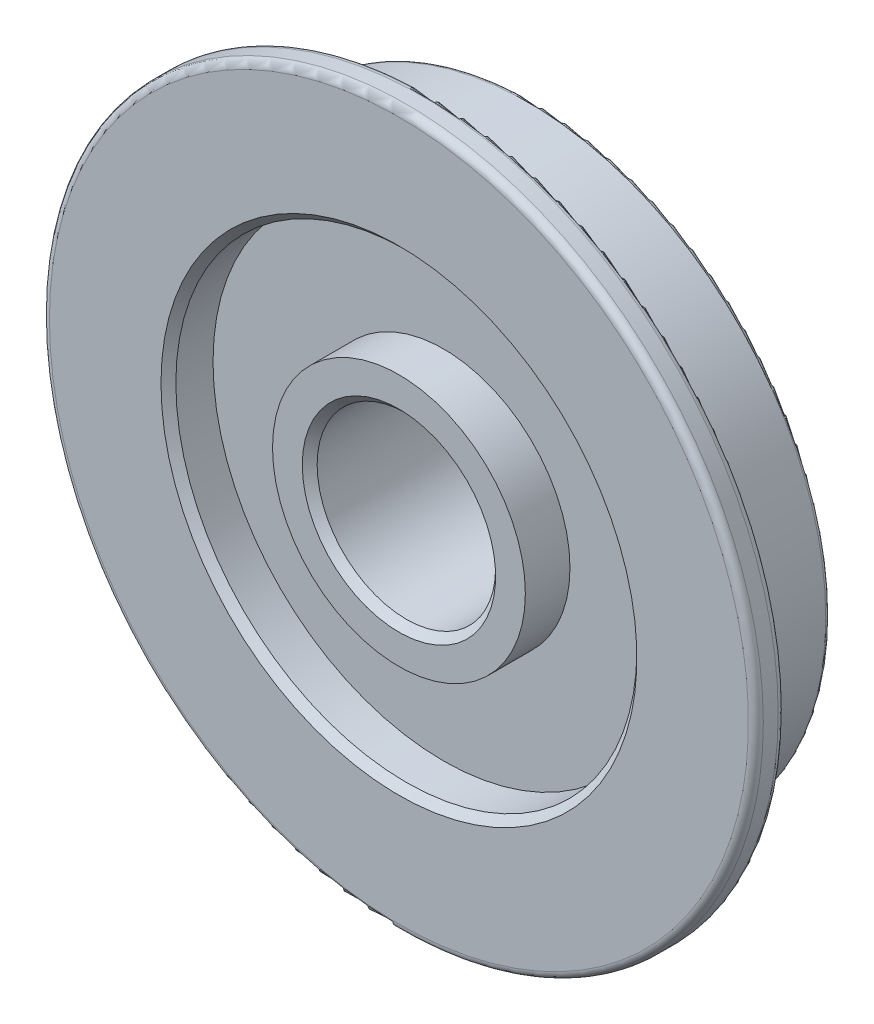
ISO-10303-21;
HEADER;
FILE_DESCRIPTION(('STEP AP214'),'2;1');
FILE_NAME('part.step','',(''),(''),'','','');
FILE_SCHEMA(('AUTOMOTIVE_DESIGN { 1 0 10303 214 1 1 1 1 }'));
ENDSEC;
DATA;
#1=APPLICATION_CONTEXT('core data for automotive mechanical design processes');
#2=APPLICATION_PROTOCOL_DEFINITION('international standard','automotive_design',2000,#1);
#3=PRODUCT_CONTEXT('',#1,'mechanical');
#4=PRODUCT('Part','Part','',(#3));
#5=PRODUCT_RELATED_PRODUCT_CATEGORY('part','',(#4));
#6=PRODUCT_DEFINITION_FORMATION('','',#4);
#7=PRODUCT_DEFINITION_CONTEXT('part definition',#1,'design');
#8=PRODUCT_DEFINITION('design','',#6,#7);
#9=PRODUCT_DEFINITION_SHAPE('','',#8);
#10=(LENGTH_UNIT() NAMED_UNIT(*) SI_UNIT(.MILLI.,.METRE.));
#11=(NAMED_UNIT(*) PLANE_ANGLE_UNIT() SI_UNIT($,.RADIAN.));
#12=(NAMED_UNIT(*) SI_UNIT($,.STERADIAN.) SOLID_ANGLE_UNIT());
#13=UNCERTAINTY_MEASURE_WITH_UNIT(LENGTH_MEASURE(1.E-05),#10,'distance_accuracy_value','');
#14=(GEOMETRIC_REPRESENTATION_CONTEXT(3) GLOBAL_UNCERTAINTY_ASSIGNED_CONTEXT((#13)) GLOBAL_UNIT_ASSIGNED_CONTEXT((#10,
#11,#12)) REPRESENTATION_CONTEXT('',''));
#15=CARTESIAN_POINT('',(0.,0.,0.));
#16=DIRECTION('',(0.,0.,1.));
#17=DIRECTION('',(1.,0.,0.));
#18=AXIS2_PLACEMENT_3D('',#15,#16,#17);
#19=CARTESIAN_POINT('',(-6.38378239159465E-13,2.49713444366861E-12,50.));
#20=DIRECTION('',(0.,0.,1.));
#21=DIRECTION('',(1.00000000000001,0.,0.));
#22=AXIS2_PLACEMENT_3D('',#19,#20,#21);
#23=CYLINDRICAL_SURFACE('',#22,8.49999999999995);
#24=CARTESIAN_POINT('',(0.,0.,0.));
#25=DIRECTION('',(0.,0.,1.));
#26=DIRECTION('',(1.00000000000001,0.,0.));
#27=AXIS2_PLACEMENT_3D('',#24,#25,#26);
#28=CIRCLE('',#27,8.49999999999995);
#29=CARTESIAN_POINT('',(8.50000000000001,0.,0.));
#30=VERTEX_POINT('',#29);
#31=EDGE_CURVE('E77',#30,#30,#28,.T.);
#32=ORIENTED_EDGE('',*,*,#31,.F.);
#33=EDGE_LOOP('',(#32));
#34=FACE_BOUND('',#33,.T.);
#35=CARTESIAN_POINT('',(-3.91700560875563E-12,1.40998324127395E-11,-3.));
#36=DIRECTION('',(0.,0.,1.));
#37=DIRECTION('',(1.00000000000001,0.,0.));
#38=AXIS2_PLACEMENT_3D('',#35,#36,#37);
#39=CIRCLE('',#38,8.49999999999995);
#40=CARTESIAN_POINT('',(8.4999999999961,1.41270614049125E-11,-3.));
#41=VERTEX_POINT('',#40);
#42=EDGE_CURVE('E89',#41,#41,#39,.T.);
#43=ORIENTED_EDGE('',*,*,#42,.T.);
#44=EDGE_LOOP('',(#43));
#45=FACE_BOUND('',#44,.T.);
#46=ADVANCED_FACE('F28',(#34,#45),#23,.T.);
#47=CARTESIAN_POINT('',(0.,6.00000000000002,0.));
#48=DIRECTION('',(0.,0.,-1.));
#49=DIRECTION('',(-1.00000000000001,0.,0.));
#50=AXIS2_PLACEMENT_3D('',#47,#48,#49);
#51=PLANE('',#50);
#52=CARTESIAN_POINT('',(0.,0.,0.));
#53=DIRECTION('',(0.,0.,-1.));
#54=DIRECTION('',(-1.00000000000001,0.,0.));
#55=AXIS2_PLACEMENT_3D('',#52,#53,#54);
#56=CIRCLE('',#55,6.5);
#57=CARTESIAN_POINT('',(-6.50000000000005,0.,0.));
#58=VERTEX_POINT('',#57);
#59=EDGE_CURVE('E71',#58,#58,#56,.T.);
#60=ORIENTED_EDGE('',*,*,#59,.T.);
#61=EDGE_LOOP('',(#60));
#62=FACE_BOUND('',#61,.T.);
#63=ORIENTED_EDGE('',*,*,#31,.T.);
#64=EDGE_LOOP('',(#63));
#65=FACE_BOUND('',#64,.T.);
#66=ADVANCED_FACE('F113',(#62,#65),#51,.F.);
#67=CARTESIAN_POINT('',(-6.38378239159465E-13,2.49713444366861E-12,50.));
#68=DIRECTION('',(0.,0.,1.));
#69=DIRECTION('',(1.00000000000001,0.,0.));
#70=AXIS2_PLACEMENT_3D('',#67,#68,#69);
#71=CYLINDRICAL_SURFACE('',#70,6.);
#72=CARTESIAN_POINT('',(0.,3.20056481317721E-13,-10.));
#73=DIRECTION('',(0.,0.,1.));
#74=DIRECTION('',(1.00000000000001,0.,0.));
#75=AXIS2_PLACEMENT_3D('',#72,#73,#74);
#76=CIRCLE('',#75,6.);
#77=CARTESIAN_POINT('',(6.00000000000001,3.39276946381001E-13,-10.));
#78=VERTEX_POINT('',#77);
#79=EDGE_CURVE('E10',#78,#78,#76,.F.);
#80=ORIENTED_EDGE('',*,*,#79,.T.);
#81=EDGE_LOOP('',(#80));
#82=FACE_BOUND('',#81,.T.);
#83=CARTESIAN_POINT('',(0.,0.,-0.5));
#84=DIRECTION('',(0.,0.,-1.));
#85=DIRECTION('',(-1.00000000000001,0.,0.));
#86=AXIS2_PLACEMENT_3D('',#83,#84,#85);
#87=CIRCLE('',#86,6.);
#88=CARTESIAN_POINT('',(-6.00000000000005,0.,-0.500000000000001));
#89=VERTEX_POINT('',#88);
#90=EDGE_CURVE('E74',#89,#89,#87,.F.);
#91=ORIENTED_EDGE('',*,*,#90,.T.);
#92=EDGE_LOOP('',(#91));
#93=FACE_BOUND('',#92,.T.);
#94=ADVANCED_FACE('F118',(#82,#93),#71,.F.);
#95=CARTESIAN_POINT('',(1.42247325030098E-13,13.7500000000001,-11.9999999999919));
#96=DIRECTION('',(0.,0.,1.));
#97=DIRECTION('',(1.00000000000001,0.,0.));
#98=AXIS2_PLACEMENT_3D('',#95,#96,#97);
#99=PLANE('',#98);
#100=CARTESIAN_POINT('',(0.,2.77555756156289E-13,-12.));
#101=DIRECTION('',(0.,0.,1.));
#102=DIRECTION('',(1.00000000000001,0.,0.));
#103=AXIS2_PLACEMENT_3D('',#100,#101,#102);
#104=CIRCLE('',#103,8.00000000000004);
#105=CARTESIAN_POINT('',(8.00000000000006,3.03183042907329E-13,-12.));
#106=VERTEX_POINT('',#105);
#107=EDGE_CURVE('E34',#106,#106,#104,.T.);
#108=ORIENTED_EDGE('',*,*,#107,.T.);
#109=EDGE_LOOP('',(#108));
#110=FACE_BOUND('',#109,.T.);
#111=CARTESIAN_POINT('',(0.,2.77555756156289E-13,-12.));
#112=DIRECTION('',(0.,0.,1.));
#113=DIRECTION('',(1.00000000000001,0.,0.));
#114=AXIS2_PLACEMENT_3D('',#111,#112,#113);
#115=CIRCLE('',#114,13.45);
#116=CARTESIAN_POINT('',(13.4500000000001,3.20641632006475E-13,-12.));
#117=VERTEX_POINT('',#116);
#118=EDGE_CURVE('E38',#117,#117,#115,.F.);
#119=ORIENTED_EDGE('',*,*,#118,.T.);
#120=EDGE_LOOP('',(#119));
#121=FACE_BOUND('',#120,.T.);
#122=ADVANCED_FACE('F125',(#110,#121),#99,.F.);
#123=CARTESIAN_POINT('',(-6.38378239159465E-13,2.49713444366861E-12,50.));
#124=DIRECTION('',(0.,0.,1.));
#125=DIRECTION('',(1.00000000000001,0.,0.));
#126=AXIS2_PLACEMENT_3D('',#123,#124,#125);
#127=CYLINDRICAL_SURFACE('',#126,13.75);
#128=CARTESIAN_POINT('',(0.,2.77555756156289E-13,-11.7));
#129=DIRECTION('',(0.,0.,1.));
#130=DIRECTION('',(1.00000000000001,0.,0.));
#131=AXIS2_PLACEMENT_3D('',#128,#129,#130);
#132=CIRCLE('',#131,13.75);
#133=CARTESIAN_POINT('',(13.7500000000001,3.21602655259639E-13,-11.7));
#134=VERTEX_POINT('',#133);
#135=EDGE_CURVE('E42',#134,#134,#132,.T.);
#136=ORIENTED_EDGE('',*,*,#135,.T.);
#137=EDGE_LOOP('',(#136));
#138=FACE_BOUND('',#137,.T.);
#139=CARTESIAN_POINT('',(0.,3.7470027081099E-13,-9.00000000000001));
#140=DIRECTION('',(0.,0.,1.));
#141=DIRECTION('',(1.00000000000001,0.,0.));
#142=AXIS2_PLACEMENT_3D('',#139,#140,#141);
#143=CIRCLE('',#142,13.75);
#144=CARTESIAN_POINT('',(13.75,4.1874716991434E-13,-9.00000000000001));
#145=VERTEX_POINT('',#144);
#146=EDGE_CURVE('E80',#145,#145,#143,.T.);
#147=ORIENTED_EDGE('',*,*,#146,.F.);
#148=EDGE_LOOP('',(#147));
#149=FACE_BOUND('',#148,.T.);
#150=ADVANCED_FACE('F130',(#138,#149),#127,.T.);
#151=CARTESIAN_POINT('',(-7.45931094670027E-13,20.0000000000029,-8.99999999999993));
#152=DIRECTION('',(0.,0.,1.));
#153=DIRECTION('',(1.00000000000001,0.,0.));
#154=AXIS2_PLACEMENT_3D('',#151,#152,#153);
#155=PLANE('',#154);
#156=CARTESIAN_POINT('',(0.,3.7470027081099E-13,-9.00000000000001));
#157=DIRECTION('',(0.,0.,1.));
#158=DIRECTION('',(1.00000000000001,0.,0.));
#159=AXIS2_PLACEMENT_3D('',#156,#157,#158);
#160=CIRCLE('',#159,19.7);
#161=CARTESIAN_POINT('',(19.7000000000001,4.37807464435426E-13,-9.00000000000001));
#162=VERTEX_POINT('',#161);
#163=EDGE_CURVE('E47',#162,#162,#160,.F.);
#164=ORIENTED_EDGE('',*,*,#163,.T.);
#165=EDGE_LOOP('',(#164));
#166=FACE_BOUND('',#165,.T.);
#167=ORIENTED_EDGE('',*,*,#146,.T.);
#168=EDGE_LOOP('',(#167));
#169=FACE_BOUND('',#168,.T.);
#170=ADVANCED_FACE('F133',(#166,#169),#155,.F.);
#171=CARTESIAN_POINT('',(-6.38378239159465E-13,2.49713444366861E-12,50.));
#172=DIRECTION('',(0.,0.,1.));
#173=DIRECTION('',(1.00000000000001,0.,0.));
#174=AXIS2_PLACEMENT_3D('',#171,#172,#173);
#175=CYLINDRICAL_SURFACE('',#174,20.);
#176=CARTESIAN_POINT('',(-3.88578058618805E-13,1.37390099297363E-12,-8.69999999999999));
#177=DIRECTION('',(0.,0.,1.));
#178=DIRECTION('',(1.00000000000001,0.,0.));
#179=AXIS2_PLACEMENT_3D('',#176,#177,#178);
#180=CIRCLE('',#179,20.);
#181=CARTESIAN_POINT('',(19.9999999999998,1.43796920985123E-12,-8.69999999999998));
#182=VERTEX_POINT('',#181);
#183=EDGE_CURVE('E50',#182,#182,#180,.T.);
#184=ORIENTED_EDGE('',*,*,#183,.T.);
#185=EDGE_LOOP('',(#184));
#186=FACE_BOUND('',#185,.T.);
#187=CARTESIAN_POINT('',(-3.86149445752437E-12,1.4210854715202E-11,-2.));
#188=DIRECTION('',(0.,0.,1.));
#189=DIRECTION('',(1.00000000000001,0.,0.));
#190=AXIS2_PLACEMENT_3D('',#187,#188,#189);
#191=CIRCLE('',#190,20.);
#192=CARTESIAN_POINT('',(19.9999999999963,1.42749229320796E-11,-2.));
#193=VERTEX_POINT('',#192);
#194=EDGE_CURVE('E83',#193,#193,#191,.T.);
#195=ORIENTED_EDGE('',*,*,#194,.F.);
#196=EDGE_LOOP('',(#195));
#197=FACE_BOUND('',#196,.T.);
#198=ADVANCED_FACE('F137',(#186,#197),#175,.T.);
#199=CARTESIAN_POINT('',(-1.66186508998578E-12,24.0000000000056,-2.));
#200=DIRECTION('',(0.,0.,1.));
#201=DIRECTION('',(1.00000000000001,0.,0.));
#202=AXIS2_PLACEMENT_3D('',#199,#200,#201);
#203=PLANE('',#202);
#204=CARTESIAN_POINT('',(-3.86149445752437E-12,1.4210854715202E-11,-2.));
#205=DIRECTION('',(0.,0.,1.));
#206=DIRECTION('',(1.00000000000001,0.,0.));
#207=AXIS2_PLACEMENT_3D('',#204,#205,#206);
#208=CIRCLE('',#207,23.5);
#209=CARTESIAN_POINT('',(23.4999999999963,1.42861348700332E-11,-2.));
#210=VERTEX_POINT('',#209);
#211=EDGE_CURVE('E53',#210,#210,#208,.F.);
#212=ORIENTED_EDGE('',*,*,#211,.T.);
#213=EDGE_LOOP('',(#212));
#214=FACE_BOUND('',#213,.T.);
#215=ORIENTED_EDGE('',*,*,#194,.T.);
#216=EDGE_LOOP('',(#215));
#217=FACE_BOUND('',#216,.T.);
#218=ADVANCED_FACE('F141',(#214,#217),#203,.F.);
#219=CARTESIAN_POINT('',(-6.38378239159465E-13,2.49713444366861E-12,50.));
#220=DIRECTION('',(0.,0.,1.));
#221=DIRECTION('',(1.00000000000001,0.,0.));
#222=AXIS2_PLACEMENT_3D('',#219,#220,#221);
#223=CYLINDRICAL_SURFACE('',#222,24.);
#224=CARTESIAN_POINT('',(0.,0.,-0.5));
#225=DIRECTION('',(0.,0.,-1.));
#226=DIRECTION('',(-1.00000000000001,0.,0.));
#227=AXIS2_PLACEMENT_3D('',#224,#225,#226);
#228=CIRCLE('',#227,24.);
#229=CARTESIAN_POINT('',(-24.0000000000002,0.,-0.500000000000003));
#230=VERTEX_POINT('',#229);
#231=EDGE_CURVE('E56',#230,#230,#228,.T.);
#232=ORIENTED_EDGE('',*,*,#231,.T.);
#233=EDGE_LOOP('',(#232));
#234=FACE_BOUND('',#233,.T.);
#235=CARTESIAN_POINT('',(0.,0.,-1.5));
#236=DIRECTION('',(0.,0.,1.));
#237=DIRECTION('',(1.00000000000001,0.,0.));
#238=AXIS2_PLACEMENT_3D('',#235,#236,#237);
#239=CIRCLE('',#238,24.);
#240=CARTESIAN_POINT('',(24.0000000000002,1.74026374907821E-13,-1.5));
#241=VERTEX_POINT('',#240);
#242=EDGE_CURVE('E59',#241,#241,#239,.T.);
#243=ORIENTED_EDGE('',*,*,#242,.T.);
#244=EDGE_LOOP('',(#243));
#245=FACE_BOUND('',#244,.T.);
#246=ADVANCED_FACE('F109',(#234,#245),#223,.T.);
#247=CARTESIAN_POINT('',(0.,15.5000000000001,7.66053886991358E-12));
#248=DIRECTION('',(0.,0.,-1.));
#249=DIRECTION('',(-1.00000000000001,0.,0.));
#250=AXIS2_PLACEMENT_3D('',#247,#248,#249);
#251=PLANE('',#250);
#252=CARTESIAN_POINT('',(0.,0.,0.));
#253=DIRECTION('',(0.,0.,-1.));
#254=DIRECTION('',(-1.00000000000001,0.,0.));
#255=AXIS2_PLACEMENT_3D('',#252,#253,#254);
#256=CIRCLE('',#255,23.5);
#257=CARTESIAN_POINT('',(-23.5000000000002,0.,0.));
#258=VERTEX_POINT('',#257);
#259=EDGE_CURVE('E62',#258,#258,#256,.F.);
#260=ORIENTED_EDGE('',*,*,#259,.T.);
#261=EDGE_LOOP('',(#260));
#262=FACE_BOUND('',#261,.T.);
#263=CARTESIAN_POINT('',(0.,0.,0.));
#264=DIRECTION('',(0.,0.,-1.));
#265=DIRECTION('',(-1.00000000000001,0.,0.));
#266=AXIS2_PLACEMENT_3D('',#263,#264,#265);
#267=CIRCLE('',#266,15.9999999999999);
#268=CARTESIAN_POINT('',(-16.,0.,0.));
#269=VERTEX_POINT('',#268);
#270=EDGE_CURVE('E65',#269,#269,#267,.T.);
#271=ORIENTED_EDGE('',*,*,#270,.T.);
#272=EDGE_LOOP('',(#271));
#273=FACE_BOUND('',#272,.T.);
#274=ADVANCED_FACE('F103',(#262,#273),#251,.F.);
#275=CARTESIAN_POINT('',(-6.38378239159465E-13,2.49713444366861E-12,50.));
#276=DIRECTION('',(0.,0.,1.));
#277=DIRECTION('',(1.00000000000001,0.,0.));
#278=AXIS2_PLACEMENT_3D('',#275,#276,#277);
#279=CYLINDRICAL_SURFACE('',#278,15.4999999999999);
#280=CARTESIAN_POINT('',(0.,0.,-0.499999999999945));
#281=DIRECTION('',(0.,0.,-1.));
#282=DIRECTION('',(-1.00000000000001,0.,0.));
#283=AXIS2_PLACEMENT_3D('',#280,#281,#282);
#284=CIRCLE('',#283,15.4999999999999);
#285=CARTESIAN_POINT('',(-15.5,0.,-0.499999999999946));
#286=VERTEX_POINT('',#285);
#287=EDGE_CURVE('E68',#286,#286,#284,.F.);
#288=ORIENTED_EDGE('',*,*,#287,.T.);
#289=EDGE_LOOP('',(#288));
#290=FACE_BOUND('',#289,.T.);
#291=CARTESIAN_POINT('',(-3.91700560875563E-12,1.40998324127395E-11,-3.));
#292=DIRECTION('',(0.,0.,1.));
#293=DIRECTION('',(1.00000000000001,0.,0.));
#294=AXIS2_PLACEMENT_3D('',#291,#292,#293);
#295=CIRCLE('',#294,15.5);
#296=CARTESIAN_POINT('',(15.4999999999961,1.41494852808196E-11,-3.));
#297=VERTEX_POINT('',#296);
#298=EDGE_CURVE('E86',#297,#297,#295,.T.);
#299=ORIENTED_EDGE('',*,*,#298,.F.);
#300=EDGE_LOOP('',(#299));
#301=FACE_BOUND('',#300,.T.);
#302=ADVANCED_FACE('F98',(#290,#301),#279,.F.);
#303=CARTESIAN_POINT('',(0.,8.50000000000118,-3.00000000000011));
#304=DIRECTION('',(0.,0.,-1.));
#305=DIRECTION('',(-1.00000000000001,0.,0.));
#306=AXIS2_PLACEMENT_3D('',#303,#304,#305);
#307=PLANE('',#306);
#308=ORIENTED_EDGE('',*,*,#42,.F.);
#309=EDGE_LOOP('',(#308));
#310=FACE_BOUND('',#309,.T.);
#311=ORIENTED_EDGE('',*,*,#298,.T.);
#312=EDGE_LOOP('',(#311));
#313=FACE_BOUND('',#312,.T.);
#314=ADVANCED_FACE('F94',(#310,#313),#307,.F.);
#315=CARTESIAN_POINT('',(0.,0.,-0.5));
#316=DIRECTION('',(0.,0.,1.));
#317=DIRECTION('',(1.00000000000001,0.,0.));
#318=AXIS2_PLACEMENT_3D('',#315,#316,#317);
#319=CONICAL_SURFACE('',#318,6.,0.78539816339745);
#320=ORIENTED_EDGE('',*,*,#59,.F.);
#321=EDGE_LOOP('',(#320));
#322=FACE_BOUND('',#321,.T.);
#323=ORIENTED_EDGE('',*,*,#90,.F.);
#324=EDGE_LOOP('',(#323));
#325=FACE_BOUND('',#324,.T.);
#326=ADVANCED_FACE('F97',(#322,#325),#319,.F.);
#327=CARTESIAN_POINT('',(0.,0.,-0.499999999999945));
#328=DIRECTION('',(0.,0.,1.));
#329=DIRECTION('',(1.00000000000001,0.,0.));
#330=AXIS2_PLACEMENT_3D('',#327,#328,#329);
#331=CONICAL_SURFACE('',#330,15.4999999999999,0.785398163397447);
#332=ORIENTED_EDGE('',*,*,#270,.F.);
#333=EDGE_LOOP('',(#332));
#334=FACE_BOUND('',#333,.T.);
#335=ORIENTED_EDGE('',*,*,#287,.F.);
#336=EDGE_LOOP('',(#335));
#337=FACE_BOUND('',#336,.T.);
#338=ADVANCED_FACE('F167',(#334,#337),#331,.F.);
#339=CARTESIAN_POINT('',(0.,0.,-0.5));
#340=DIRECTION('',(0.,0.,-1.));
#341=DIRECTION('',(-1.00000000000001,0.,0.));
#342=AXIS2_PLACEMENT_3D('',#339,#340,#341);
#343=TOROIDAL_SURFACE('',#342,23.5,0.5);
#344=ORIENTED_EDGE('',*,*,#231,.F.);
#345=EDGE_LOOP('',(#344));
#346=FACE_BOUND('',#345,.T.);
#347=ORIENTED_EDGE('',*,*,#259,.F.);
#348=EDGE_LOOP('',(#347));
#349=FACE_BOUND('',#348,.T.);
#350=ADVANCED_FACE('F157',(#346,#349),#343,.T.);
#351=CARTESIAN_POINT('',(0.,0.,-1.5));
#352=DIRECTION('',(0.,0.,1.));
#353=DIRECTION('',(1.00000000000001,0.,0.));
#354=AXIS2_PLACEMENT_3D('',#351,#352,#353);
#355=TOROIDAL_SURFACE('',#354,23.5,0.5);
#356=ORIENTED_EDGE('',*,*,#211,.F.);
#357=EDGE_LOOP('',(#356));
#358=FACE_BOUND('',#357,.T.);
#359=ORIENTED_EDGE('',*,*,#242,.F.);
#360=EDGE_LOOP('',(#359));
#361=FACE_BOUND('',#360,.T.);
#362=ADVANCED_FACE('F154',(#358,#361),#355,.T.);
#363=CARTESIAN_POINT('',(-3.88578058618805E-13,1.37390099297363E-12,-8.69999999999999));
#364=DIRECTION('',(0.,0.,1.));
#365=DIRECTION('',(1.00000000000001,0.,0.));
#366=AXIS2_PLACEMENT_3D('',#363,#364,#365);
#367=TOROIDAL_SURFACE('',#366,19.7,0.3);
#368=ORIENTED_EDGE('',*,*,#163,.F.);
#369=EDGE_LOOP('',(#368));
#370=FACE_BOUND('',#369,.T.);
#371=ORIENTED_EDGE('',*,*,#183,.F.);
#372=EDGE_LOOP('',(#371));
#373=FACE_BOUND('',#372,.T.);
#374=ADVANCED_FACE('F156',(#370,#373),#367,.T.);
#375=CARTESIAN_POINT('',(0.,2.77555756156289E-13,-11.7));
#376=DIRECTION('',(0.,0.,1.));
#377=DIRECTION('',(1.00000000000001,0.,0.));
#378=AXIS2_PLACEMENT_3D('',#375,#376,#377);
#379=TOROIDAL_SURFACE('',#378,13.45,0.3);
#380=ORIENTED_EDGE('',*,*,#118,.F.);
#381=EDGE_LOOP('',(#380));
#382=FACE_BOUND('',#381,.T.);
#383=ORIENTED_EDGE('',*,*,#135,.F.);
#384=EDGE_LOOP('',(#383));
#385=FACE_BOUND('',#384,.T.);
#386=ADVANCED_FACE('F164',(#382,#385),#379,.T.);
#387=CARTESIAN_POINT('',(0.,2.77555756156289E-13,-12.));
#388=DIRECTION('',(0.,0.,-1.));
#389=DIRECTION('',(-1.00000000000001,0.,0.));
#390=AXIS2_PLACEMENT_3D('',#387,#388,#389);
#391=CONICAL_SURFACE('',#390,8.00000000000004,0.785398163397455);
#392=ORIENTED_EDGE('',*,*,#79,.F.);
#393=EDGE_LOOP('',(#392));
#394=FACE_BOUND('',#393,.T.);
#395=ORIENTED_EDGE('',*,*,#107,.F.);
#396=EDGE_LOOP('',(#395));
#397=FACE_BOUND('',#396,.T.);
#398=ADVANCED_FACE('F196',(#394,#397),#391,.F.);
#399=CLOSED_SHELL('',(#46,#66,#94,#122,#150,#170,#198,#218,#246,#274,#302,#314,#326,#338,#350,
#362,#374,#386,#398));
#400=MANIFOLD_SOLID_BREP('B2',#399);
#401=ADVANCED_BREP_SHAPE_REPRESENTATION('',(#18,#400),#14);
#402=SHAPE_DEFINITION_REPRESENTATION(#9,#401);
ENDSEC;
END-ISO-10303-21;
